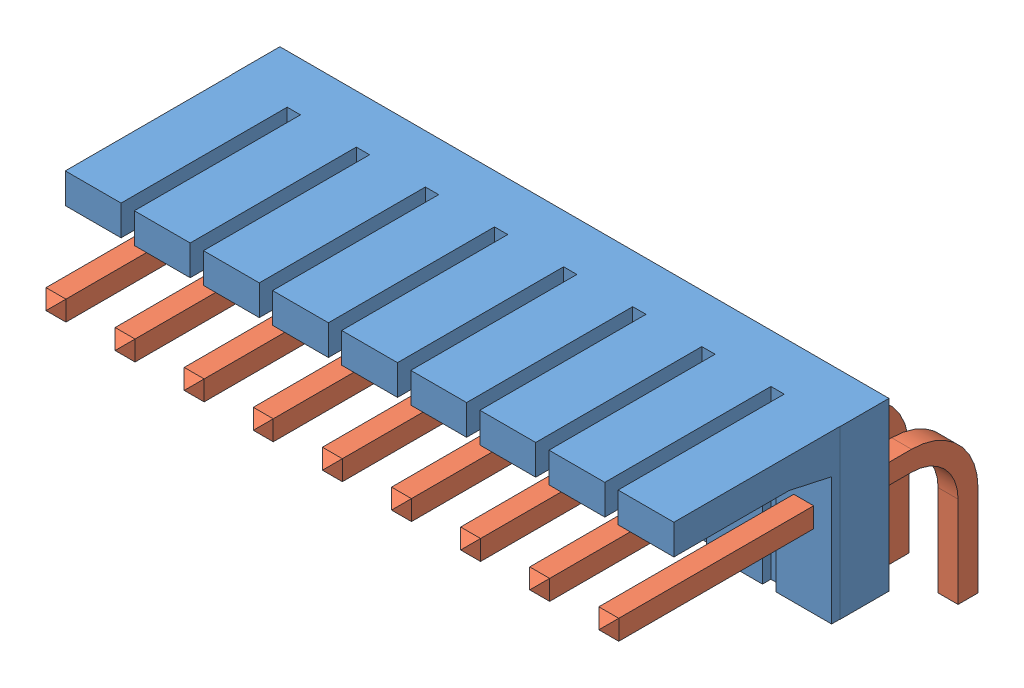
SolidWorks assembly .156 Connector 9 pin.SLDASM, configuration Default (file format 8000). Lengths in mm.
Overall size (34.92 13.83 21.17).
10 component instances, 2 part files, 3 mates.
Components (placement in the parent):
- Connector Body-1: Connector Body.SLDPRT [Default] at origin size (34.92 9.58 12.32)
- Connector Pins-1: Connector Pins.SLDPRT [Default] at (-15.8496 -3.683 -6.1468) size (1.14 9.61 21.17)
- Connector Pins-2: Connector Pins.SLDPRT [Default] at (-11.8872 -3.683 -6.1468) size (1.14 9.61 21.17)
- Connector Pins-3: Connector Pins.SLDPRT [Default] at (-7.9248 -3.683 -6.1468) size (1.14 9.61 21.17)
- Connector Pins-4: Connector Pins.SLDPRT [Default] at (-3.9624 -3.683 -6.1468) size (1.14 9.61 21.17)
- Connector Pins-5: Connector Pins.SLDPRT [Default] at (0 -3.683 -6.1468) size (1.14 9.61 21.17)
- Connector Pins-6: Connector Pins.SLDPRT [Default] at (3.9624 -3.683 -6.1468) size (1.14 9.61 21.17)
- Connector Pins-7: Connector Pins.SLDPRT [Default] at (7.9248 -3.683 -6.1468) size (1.14 9.61 21.17)
- Connector Pins-8: Connector Pins.SLDPRT [Default] at (11.8872 -3.683 -6.1468) size (1.14 9.61 21.17)
- Connector Pins-9: Connector Pins.SLDPRT [Default] at (15.8496 -3.683 -6.1468) size (1.14 9.61 21.17)
Mates (geometry in assembly coordinates):
- Coincident1: coincident anti-aligned: plane of Connector Body-1 through (-16.4211 4.2164 0) normal (0 1 0); plane of Connector Pins-1 through (-15.2781 4.2164 -2.3368) normal (0 -1 0)
- Coincident2: coincident anti-aligned: plane of Connector Body-1 through (-15.2781 4.2164 0) normal (-1 0 0); plane of Connector Pins-1 through (-15.2781 1.5494 -2.3368) normal (1 0 0)
- Distance1: distance = 5.0038 mm anti-aligned: plane of Connector Body-1 through (17.4625 0 0) normal (0 0 -1); plane of Connector Pins-1 through (-15.2781 -3.683 -5.0038) normal (0 0 1)
